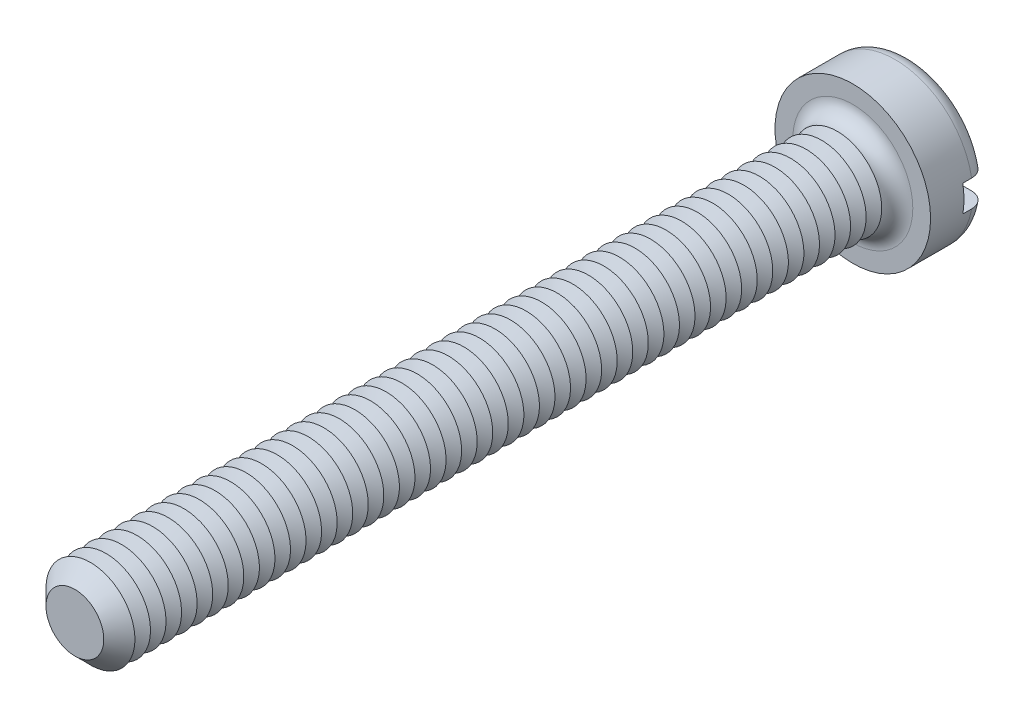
from build123d import *

# Parameters (mm, degrees)
SKETCH3_R           = 3.5
BOSS_EXTRUDE2_DEPTH = 2.6
SKETCH4_R           = 2
BOSS_EXTRUDE3_DEPTH = 35
FILLET1_R           = 0.7
CHAMFER1_SIZE       = 0.7
LPATTERN1_COUNT     = 48
LPATTERN1_PITCH     = 0.7
SKETCH8_W           = 7
SKETCH8_H           = 1.2
CUT_EXTRUDE1_DEPTH  = 1.1


with BuildPart() as part:
    # Sketch3 → Boss-Extrude2 (new body)
    with BuildSketch(Plane.XY):
        Circle(SKETCH3_R)
    extrude(amount=-BOSS_EXTRUDE2_DEPTH)

    # Sketch4 → Boss-Extrude3 (add)
    with BuildSketch(Plane.XY):
        Circle(SKETCH4_R)
    extrude(amount=BOSS_EXTRUDE3_DEPTH)

    # Fillet1
    fillet1_edges = [part.edges().sort_by_distance(p)[0] for p in [
        (-3.5, 0, -2.6),
        (-2, 0, 0),
    ]]
    fillet(fillet1_edges, radius=FILLET1_R)

    # Chamfer1
    chamfer1_edges = [part.edges().sort_by_distance(p)[0] for p in [
        (-2, 0, 35),
    ]]
    chamfer(chamfer1_edges, length=CHAMFER1_SIZE)

    # Sketch6 → Cut-Revolve1 (revolve, cut)
    with BuildSketch(Plane(origin=(0, 0, 0), x_dir=(0, 0, -1), z_dir=(1, 0, 0)), mode=Mode.PRIVATE) as cut_revolve1_sk:
        Polygon((-0.7, 2), (-1.05, 1.393782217), (-1.4, 2), align=None)
    cut_revolve1 = revolve(cut_revolve1_sk.sketch.rotate(Axis((0, 0, -1.694361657), (0, 0, 1)), 90), axis=Axis((0, 0, -1.694361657), (0, 0, 1)), mode=Mode.SUBTRACT)

    # LPattern1: Cut-Revolve1 ×48
    with Locations(*[(0, 0, i * LPATTERN1_PITCH) for i in range(1, LPATTERN1_COUNT)]):
        add(cut_revolve1, mode=Mode.SUBTRACT)

    # Sketch8 → Cut-Extrude1 (cut)
    with BuildSketch(Plane(origin=(0, 0, -2.6), x_dir=(-1, 0, 0), z_dir=(0, 0, -1))):
        Rectangle(SKETCH8_W, SKETCH8_H)
    extrude(amount=-CUT_EXTRUDE1_DEPTH, mode=Mode.SUBTRACT)


solid = part.part
